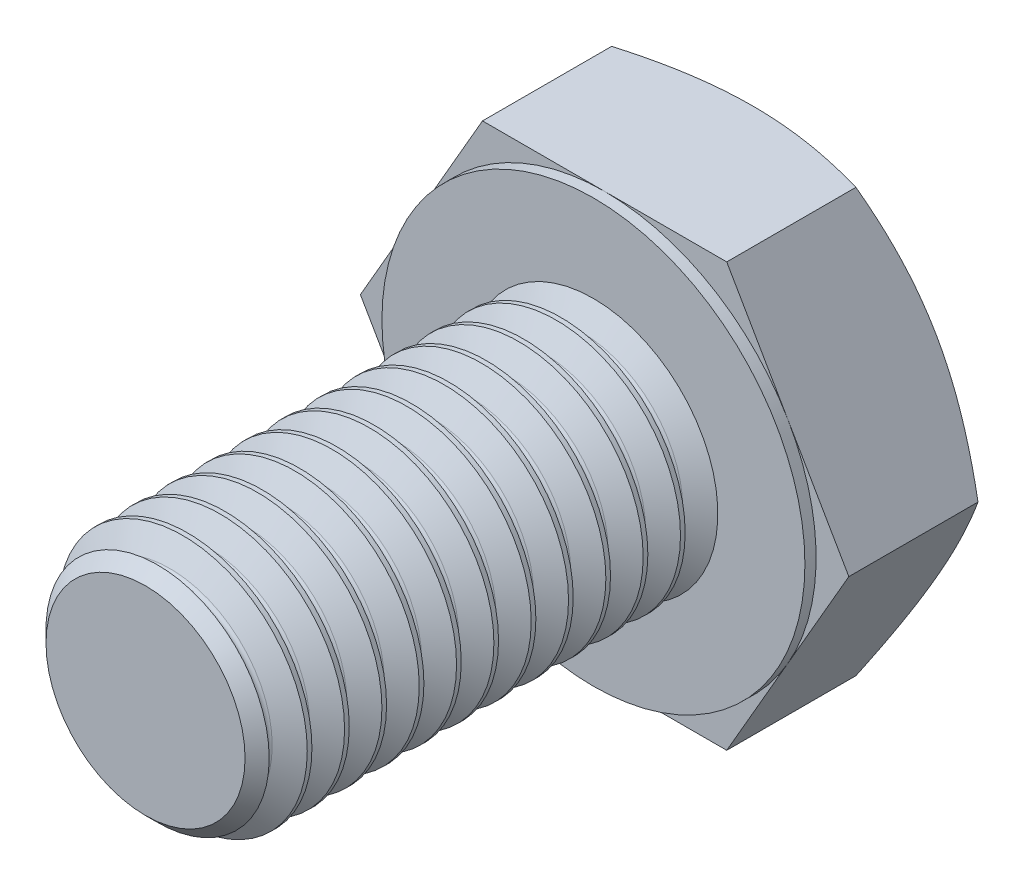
from build123d import *

# Parameters (mm, degrees)
SKETCH5_W               = 18
SKETCH5_H               = 5
THREAD_SIMPLE_COUNT     = 12
THREAD_SIMPLE_PITCH     = 1.5
SKETCH15_W              = 6.4
SKETCH15_H              = 10
SKETCH19_W              = 0.45
SKETCH19_H              = 1.5
SKETCH21_OUTSIDE_W      = 29.47
SKETCH21_OUTSIDE_H      = 29.47
CUT_PROFILE_OUTER_DEPTH = 23.891046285


with BuildPart() as part:
    # Sketch5 → body (revolve)
    with BuildSketch(Plane(origin=(0, 0, 0), x_dir=(0, 0, -1), z_dir=(1, 0, 0)), mode=Mode.PRIVATE) as body_sk:
        with Locations((-9, 2.5)):
            Rectangle(SKETCH5_W, SKETCH5_H)
    revolve(body_sk.sketch.rotate(Axis((0, 0, 18), (0, 0, -1)), 90), axis=Axis((0, 0, 18), (0, 0, -1)))

    # Sketch11 → cut-chamfer-start (revolve, cut)
    with BuildSketch(Plane(origin=(0, 0, 0), x_dir=(0, 0, -1), z_dir=(1, 0, 0)), mode=Mode.PRIVATE) as cut_chamfer_start_sk:
        Polygon((-18, -5), (-18, -4), (-17, -5), align=None)
    revolve(cut_chamfer_start_sk.sketch.rotate(Axis((0, 0, 18), (0, 0, -1)), 270), axis=Axis((0, 0, 18), (0, 0, -1)), mode=Mode.SUBTRACT)

    # Sketch8 → thread-single (revolve, cut)
    with BuildSketch(Plane(origin=(0, 0, 0), x_dir=(0, 0, -1), z_dir=(1, 0, 0)), mode=Mode.PRIVATE) as thread_single_sk:
        with BuildLine():
            Line((-1.3125, -5), (0, -5))
            Line((0, -5), (-0.515625, -4.106911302))
            ThreePointArc((-0.515625, -4.106911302), (-0.65625, -4.025721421), (-0.796875, -4.106911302))
            Line((-0.796875, -4.106911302), (-1.3125, -5))
        make_face()
    thread_single = revolve(thread_single_sk.sketch.rotate(Axis((0, 0, 18), (0, 0, -1)), 270), axis=Axis((0, 0, 18), (0, 0, -1)), mode=Mode.SUBTRACT)

    # thread-simple: thread-single ×12
    with Locations(*[(0, 0, i * THREAD_SIMPLE_PITCH) for i in range(1, THREAD_SIMPLE_COUNT)]):
        add(thread_single, mode=Mode.SUBTRACT)

    # Sketch15 → body-head (revolve)
    with BuildSketch(Plane(origin=(0, 0, 0), x_dir=(0, 0, -1), z_dir=(1, 0, 0)), mode=Mode.PRIVATE) as body_head_sk:
        with Locations((3.2, -5)):
            Rectangle(SKETCH15_W, SKETCH15_H)
    revolve(body_head_sk.sketch.rotate(Axis((0, 0, -6.4), (0, 0, 1)), 180), axis=Axis((0, 0, -6.4), (0, 0, 1)))

    # Sketch19 → cut-head-profile (revolve, cut)
    with BuildSketch(Plane(origin=(0, 0, 0), x_dir=(0, 0, -1), z_dir=(1, 0, 0)), mode=Mode.PRIVATE) as cut_head_profile_sk:
        with Locations((0.225, -9.25)):
            Rectangle(SKETCH19_W, SKETCH19_H)
        Polygon((6.4, -10), (6.4, -8.5), (5.533974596, -10), align=None)
    revolve(cut_head_profile_sk.sketch.rotate(Axis((0, 0, -6.4), (0, 0, 1)), 180), axis=Axis((0, 0, -6.4), (0, 0, 1)), mode=Mode.SUBTRACT)

    # Sketch21 outside → cut-profile-outer (cut, through all)
    with BuildSketch(Plane.XY):
        Rectangle(SKETCH21_OUTSIDE_W, SKETCH21_OUTSIDE_H)
        Polygon((9.814954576, 0), (4.907477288, 8.5), (-4.907477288, 8.5), (-9.814954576, 0), (-4.907477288, -8.5), (4.907477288, -8.5), align=None, mode=Mode.SUBTRACT)
    extrude(amount=-CUT_PROFILE_OUTER_DEPTH, mode=Mode.SUBTRACT)


solid = part.part
